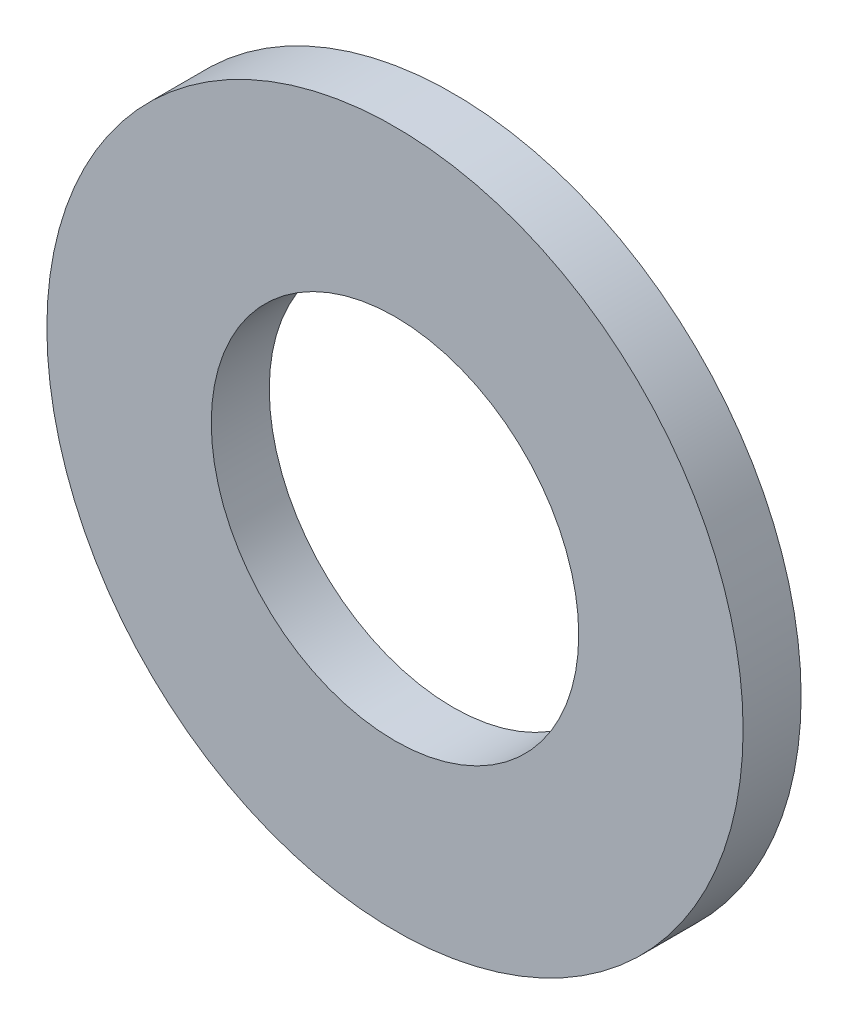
ISO-10303-21;
HEADER;
FILE_DESCRIPTION(('STEP AP214'),'2;1');
FILE_NAME('part.step','',(''),(''),'','','');
FILE_SCHEMA(('AUTOMOTIVE_DESIGN { 1 0 10303 214 1 1 1 1 }'));
ENDSEC;
DATA;
#1=APPLICATION_CONTEXT('core data for automotive mechanical design processes');
#2=APPLICATION_PROTOCOL_DEFINITION('international standard','automotive_design',2000,#1);
#3=PRODUCT_CONTEXT('',#1,'mechanical');
#4=PRODUCT('Part','Part','',(#3));
#5=PRODUCT_RELATED_PRODUCT_CATEGORY('part','',(#4));
#6=PRODUCT_DEFINITION_FORMATION('','',#4);
#7=PRODUCT_DEFINITION_CONTEXT('part definition',#1,'design');
#8=PRODUCT_DEFINITION('design','',#6,#7);
#9=PRODUCT_DEFINITION_SHAPE('','',#8);
#10=(LENGTH_UNIT() NAMED_UNIT(*) SI_UNIT(.MILLI.,.METRE.));
#11=(NAMED_UNIT(*) PLANE_ANGLE_UNIT() SI_UNIT($,.RADIAN.));
#12=(NAMED_UNIT(*) SI_UNIT($,.STERADIAN.) SOLID_ANGLE_UNIT());
#13=UNCERTAINTY_MEASURE_WITH_UNIT(LENGTH_MEASURE(1.E-05),#10,'distance_accuracy_value','');
#14=(GEOMETRIC_REPRESENTATION_CONTEXT(3) GLOBAL_UNCERTAINTY_ASSIGNED_CONTEXT((#13)) GLOBAL_UNIT_ASSIGNED_CONTEXT((#10,
#11,#12)) REPRESENTATION_CONTEXT('',''));
#15=CARTESIAN_POINT('',(0.,0.,0.));
#16=DIRECTION('',(0.,0.,1.));
#17=DIRECTION('',(1.,0.,0.));
#18=AXIS2_PLACEMENT_3D('',#15,#16,#17);
#19=CARTESIAN_POINT('',(0.,0.,3.));
#20=DIRECTION('',(0.,0.,-1.));
#21=DIRECTION('',(-1.,0.,0.));
#22=AXIS2_PLACEMENT_3D('',#19,#20,#21);
#23=CYLINDRICAL_SURFACE('',#22,18.);
#24=CARTESIAN_POINT('',(0.,0.,3.));
#25=DIRECTION('',(0.,0.,1.));
#26=DIRECTION('',(1.,0.,0.));
#27=AXIS2_PLACEMENT_3D('',#24,#25,#26);
#28=CIRCLE('',#27,18.);
#29=CARTESIAN_POINT('',(18.,0.,3.));
#30=VERTEX_POINT('',#29);
#31=EDGE_CURVE('E10',#30,#30,#28,.T.);
#32=ORIENTED_EDGE('',*,*,#31,.F.);
#33=EDGE_LOOP('',(#32));
#34=FACE_BOUND('',#33,.T.);
#35=CARTESIAN_POINT('',(0.,0.,0.));
#36=DIRECTION('',(0.,0.,1.));
#37=DIRECTION('',(1.,0.,0.));
#38=AXIS2_PLACEMENT_3D('',#35,#36,#37);
#39=CIRCLE('',#38,18.);
#40=CARTESIAN_POINT('',(18.,0.,0.));
#41=VERTEX_POINT('',#40);
#42=EDGE_CURVE('E34',#41,#41,#39,.T.);
#43=ORIENTED_EDGE('',*,*,#42,.T.);
#44=EDGE_LOOP('',(#43));
#45=FACE_BOUND('',#44,.T.);
#46=ADVANCED_FACE('F28',(#34,#45),#23,.T.);
#47=CARTESIAN_POINT('',(0.,0.,3.));
#48=DIRECTION('',(0.,0.,1.));
#49=DIRECTION('',(1.,0.,0.));
#50=AXIS2_PLACEMENT_3D('',#47,#48,#49);
#51=PLANE('',#50);
#52=CARTESIAN_POINT('',(0.,0.,3.));
#53=DIRECTION('',(0.,0.,-1.));
#54=DIRECTION('',(-1.,0.,0.));
#55=AXIS2_PLACEMENT_3D('',#52,#53,#54);
#56=CIRCLE('',#55,9.5);
#57=CARTESIAN_POINT('',(-9.5,0.,3.));
#58=VERTEX_POINT('',#57);
#59=EDGE_CURVE('E38',#58,#58,#56,.T.);
#60=ORIENTED_EDGE('',*,*,#59,.T.);
#61=EDGE_LOOP('',(#60));
#62=FACE_BOUND('',#61,.T.);
#63=ORIENTED_EDGE('',*,*,#31,.T.);
#64=EDGE_LOOP('',(#63));
#65=FACE_BOUND('',#64,.T.);
#66=ADVANCED_FACE('F53',(#62,#65),#51,.T.);
#67=CARTESIAN_POINT('',(0.,0.,0.));
#68=DIRECTION('',(0.,0.,1.));
#69=DIRECTION('',(1.,0.,0.));
#70=AXIS2_PLACEMENT_3D('',#67,#68,#69);
#71=PLANE('',#70);
#72=CARTESIAN_POINT('',(0.,0.,0.));
#73=DIRECTION('',(0.,0.,-1.));
#74=DIRECTION('',(-1.,0.,0.));
#75=AXIS2_PLACEMENT_3D('',#72,#73,#74);
#76=CIRCLE('',#75,9.5);
#77=CARTESIAN_POINT('',(-9.5,0.,0.));
#78=VERTEX_POINT('',#77);
#79=EDGE_CURVE('E42',#78,#78,#76,.T.);
#80=ORIENTED_EDGE('',*,*,#79,.F.);
#81=EDGE_LOOP('',(#80));
#82=FACE_BOUND('',#81,.T.);
#83=ORIENTED_EDGE('',*,*,#42,.F.);
#84=EDGE_LOOP('',(#83));
#85=FACE_BOUND('',#84,.T.);
#86=ADVANCED_FACE('F50',(#82,#85),#71,.F.);
#87=CARTESIAN_POINT('',(0.,0.,3.));
#88=DIRECTION('',(0.,0.,-1.));
#89=DIRECTION('',(-1.,0.,0.));
#90=AXIS2_PLACEMENT_3D('',#87,#88,#89);
#91=CYLINDRICAL_SURFACE('',#90,9.5);
#92=ORIENTED_EDGE('',*,*,#59,.F.);
#93=EDGE_LOOP('',(#92));
#94=FACE_BOUND('',#93,.T.);
#95=ORIENTED_EDGE('',*,*,#79,.T.);
#96=EDGE_LOOP('',(#95));
#97=FACE_BOUND('',#96,.T.);
#98=ADVANCED_FACE('F48',(#94,#97),#91,.F.);
#99=CLOSED_SHELL('',(#46,#66,#86,#98));
#100=MANIFOLD_SOLID_BREP('B2',#99);
#101=ADVANCED_BREP_SHAPE_REPRESENTATION('',(#18,#100),#14);
#102=SHAPE_DEFINITION_REPRESENTATION(#9,#101);
ENDSEC;
END-ISO-10303-21;
